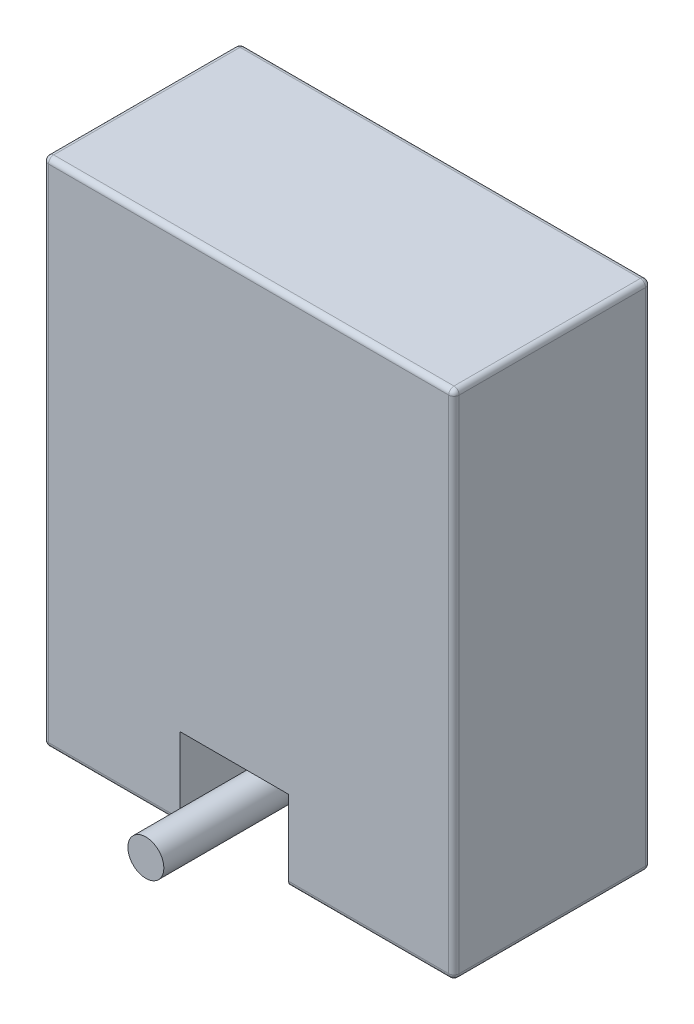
ISO-10303-21;
HEADER;
FILE_DESCRIPTION(('STEP AP214'),'2;1');
FILE_NAME('part.step','',(''),(''),'','','');
FILE_SCHEMA(('AUTOMOTIVE_DESIGN { 1 0 10303 214 1 1 1 1 }'));
ENDSEC;
DATA;
#1=APPLICATION_CONTEXT('core data for automotive mechanical design processes');
#2=APPLICATION_PROTOCOL_DEFINITION('international standard','automotive_design',2000,#1);
#3=PRODUCT_CONTEXT('',#1,'mechanical');
#4=PRODUCT('Part','Part','',(#3));
#5=PRODUCT_RELATED_PRODUCT_CATEGORY('part','',(#4));
#6=PRODUCT_DEFINITION_FORMATION('','',#4);
#7=PRODUCT_DEFINITION_CONTEXT('part definition',#1,'design');
#8=PRODUCT_DEFINITION('design','',#6,#7);
#9=PRODUCT_DEFINITION_SHAPE('','',#8);
#10=(LENGTH_UNIT() NAMED_UNIT(*) SI_UNIT(.MILLI.,.METRE.));
#11=(NAMED_UNIT(*) PLANE_ANGLE_UNIT() SI_UNIT($,.RADIAN.));
#12=(NAMED_UNIT(*) SI_UNIT($,.STERADIAN.) SOLID_ANGLE_UNIT());
#13=UNCERTAINTY_MEASURE_WITH_UNIT(LENGTH_MEASURE(1.E-05),#10,'distance_accuracy_value','');
#14=(GEOMETRIC_REPRESENTATION_CONTEXT(3) GLOBAL_UNCERTAINTY_ASSIGNED_CONTEXT((#13)) GLOBAL_UNIT_ASSIGNED_CONTEXT((#10,
#11,#12)) REPRESENTATION_CONTEXT('',''));
#15=CARTESIAN_POINT('',(0.,0.,0.));
#16=DIRECTION('',(0.,0.,1.));
#17=DIRECTION('',(1.,0.,0.));
#18=AXIS2_PLACEMENT_3D('',#15,#16,#17);
#19=CARTESIAN_POINT('',(0.,0.381,-0.381));
#20=DIRECTION('',(-1.,0.,0.));
#21=DIRECTION('',(0.,0.,1.));
#22=AXIS2_PLACEMENT_3D('',#19,#20,#21);
#23=CYLINDRICAL_SURFACE('',#22,0.381);
#24=CARTESIAN_POINT('',(9.92211623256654,0.381,-0.381));
#25=DIRECTION('',(-1.,0.,0.));
#26=DIRECTION('',(0.,0.,1.));
#27=AXIS2_PLACEMENT_3D('',#24,#25,#26);
#28=CIRCLE('',#27,0.381);
#29=CARTESIAN_POINT('',(9.92211623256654,0.381,0.));
#30=VERTEX_POINT('',#29);
#31=CARTESIAN_POINT('',(9.92211623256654,0.,-0.381));
#32=VERTEX_POINT('',#31);
#33=EDGE_CURVE('E13',#30,#32,#28,.F.);
#34=ORIENTED_EDGE('',*,*,#33,.F.);
#35=DIRECTION('',(1.,0.,0.));
#36=VECTOR('',#35,1.);
#37=CARTESIAN_POINT('',(29.8196,0.381,0.));
#38=LINE('',#37,#36);
#39=CARTESIAN_POINT('',(0.381,0.381,0.));
#40=VERTEX_POINT('',#39);
#41=EDGE_CURVE('E257',#40,#30,#38,.T.);
#42=ORIENTED_EDGE('',*,*,#41,.F.);
#43=CARTESIAN_POINT('',(0.381,0.381,-0.381));
#44=DIRECTION('',(-1.,0.,0.));
#45=DIRECTION('',(0.,0.,1.));
#46=AXIS2_PLACEMENT_3D('',#43,#44,#45);
#47=CIRCLE('',#46,0.381);
#48=CARTESIAN_POINT('',(0.381,0.,-0.381));
#49=VERTEX_POINT('',#48);
#50=EDGE_CURVE('E300',#49,#40,#47,.T.);
#51=ORIENTED_EDGE('',*,*,#50,.F.);
#52=DIRECTION('',(1.,0.,0.));
#53=VECTOR('',#52,1.);
#54=CARTESIAN_POINT('',(0.,0.,-0.381));
#55=LINE('',#54,#53);
#56=EDGE_CURVE('E209',#32,#49,#55,.F.);
#57=ORIENTED_EDGE('',*,*,#56,.F.);
#58=EDGE_LOOP('',(#34,#42,#51,#57));
#59=FACE_BOUND('',#58,.T.);
#60=ADVANCED_FACE('F47',(#59),#23,.T.);
#61=CARTESIAN_POINT('',(0.,0.,-14.2875));
#62=DIRECTION('',(-1.,0.,0.));
#63=DIRECTION('',(0.,0.,1.));
#64=AXIS2_PLACEMENT_3D('',#61,#62,#63);
#65=PLANE('',#64);
#66=DIRECTION('',(0.,-1.,0.));
#67=VECTOR('',#66,1.);
#68=CARTESIAN_POINT('',(0.,37.1348,-0.381));
#69=LINE('',#68,#67);
#70=CARTESIAN_POINT('',(0.,0.381,-0.381));
#71=VERTEX_POINT('',#70);
#72=CARTESIAN_POINT('',(0.,36.7538,-0.381));
#73=VERTEX_POINT('',#72);
#74=EDGE_CURVE('E247',#71,#73,#69,.F.);
#75=ORIENTED_EDGE('',*,*,#74,.T.);
#76=DIRECTION('',(0.,0.,1.));
#77=VECTOR('',#76,1.);
#78=CARTESIAN_POINT('',(0.,36.7538,-14.2875));
#79=LINE('',#78,#77);
#80=CARTESIAN_POINT('',(0.,36.7538,-13.9065));
#81=VERTEX_POINT('',#80);
#82=EDGE_CURVE('E252',#73,#81,#79,.F.);
#83=ORIENTED_EDGE('',*,*,#82,.T.);
#84=DIRECTION('',(0.,-1.,0.));
#85=VECTOR('',#84,1.);
#86=CARTESIAN_POINT('',(0.,0.,-13.9065));
#87=LINE('',#86,#85);
#88=CARTESIAN_POINT('',(0.,0.381,-13.9065));
#89=VERTEX_POINT('',#88);
#90=EDGE_CURVE('E249',#81,#89,#87,.T.);
#91=ORIENTED_EDGE('',*,*,#90,.T.);
#92=DIRECTION('',(0.,0.,1.));
#93=VECTOR('',#92,1.);
#94=CARTESIAN_POINT('',(0.,0.381,-14.2875));
#95=LINE('',#94,#93);
#96=EDGE_CURVE('E245',#89,#71,#95,.T.);
#97=ORIENTED_EDGE('',*,*,#96,.T.);
#98=EDGE_LOOP('',(#75,#83,#91,#97));
#99=FACE_BOUND('',#98,.T.);
#100=ADVANCED_FACE('F421',(#99),#65,.T.);
#101=CARTESIAN_POINT('',(0.,37.1348,-14.2875));
#102=DIRECTION('',(0.,1.,0.));
#103=DIRECTION('',(0.,0.,1.));
#104=AXIS2_PLACEMENT_3D('',#101,#102,#103);
#105=PLANE('',#104);
#106=DIRECTION('',(-1.,0.,0.));
#107=VECTOR('',#106,1.);
#108=CARTESIAN_POINT('',(0.,37.1348,-13.9065));
#109=LINE('',#108,#107);
#110=CARTESIAN_POINT('',(29.4386,37.1348,-13.9065));
#111=VERTEX_POINT('',#110);
#112=CARTESIAN_POINT('',(0.381,37.1348,-13.9065));
#113=VERTEX_POINT('',#112);
#114=EDGE_CURVE('E240',#111,#113,#109,.T.);
#115=ORIENTED_EDGE('',*,*,#114,.T.);
#116=DIRECTION('',(0.,0.,1.));
#117=VECTOR('',#116,1.);
#118=CARTESIAN_POINT('',(0.381,37.1348,-14.2875));
#119=LINE('',#118,#117);
#120=CARTESIAN_POINT('',(0.381,37.1348,-0.381));
#121=VERTEX_POINT('',#120);
#122=EDGE_CURVE('E243',#113,#121,#119,.T.);
#123=ORIENTED_EDGE('',*,*,#122,.T.);
#124=DIRECTION('',(-1.,0.,0.));
#125=VECTOR('',#124,1.);
#126=CARTESIAN_POINT('',(29.8196,37.1348,-0.381));
#127=LINE('',#126,#125);
#128=CARTESIAN_POINT('',(29.4386,37.1348,-0.381));
#129=VERTEX_POINT('',#128);
#130=EDGE_CURVE('E238',#121,#129,#127,.F.);
#131=ORIENTED_EDGE('',*,*,#130,.T.);
#132=DIRECTION('',(0.,0.,1.));
#133=VECTOR('',#132,1.);
#134=CARTESIAN_POINT('',(29.4386,37.1348,-14.2875));
#135=LINE('',#134,#133);
#136=EDGE_CURVE('E236',#129,#111,#135,.F.);
#137=ORIENTED_EDGE('',*,*,#136,.T.);
#138=EDGE_LOOP('',(#115,#123,#131,#137));
#139=FACE_BOUND('',#138,.T.);
#140=ADVANCED_FACE('F399',(#139),#105,.T.);
#141=CARTESIAN_POINT('',(29.8196,0.,-14.2875));
#142=DIRECTION('',(1.,0.,0.));
#143=DIRECTION('',(0.,0.,-1.));
#144=AXIS2_PLACEMENT_3D('',#141,#142,#143);
#145=PLANE('',#144);
#146=DIRECTION('',(0.,1.,0.));
#147=VECTOR('',#146,1.);
#148=CARTESIAN_POINT('',(29.8196,0.,-0.381));
#149=LINE('',#148,#147);
#150=CARTESIAN_POINT('',(29.8196,36.7538,-0.381));
#151=VERTEX_POINT('',#150);
#152=CARTESIAN_POINT('',(29.8196,0.381,-0.381));
#153=VERTEX_POINT('',#152);
#154=EDGE_CURVE('E229',#151,#153,#149,.F.);
#155=ORIENTED_EDGE('',*,*,#154,.T.);
#156=DIRECTION('',(0.,0.,1.));
#157=VECTOR('',#156,1.);
#158=CARTESIAN_POINT('',(29.8196,0.381,-14.2875));
#159=LINE('',#158,#157);
#160=CARTESIAN_POINT('',(29.8196,0.381,-13.9065));
#161=VERTEX_POINT('',#160);
#162=EDGE_CURVE('E234',#153,#161,#159,.F.);
#163=ORIENTED_EDGE('',*,*,#162,.T.);
#164=DIRECTION('',(0.,1.,0.));
#165=VECTOR('',#164,1.);
#166=CARTESIAN_POINT('',(29.8196,0.,-13.9065));
#167=LINE('',#166,#165);
#168=CARTESIAN_POINT('',(29.8196,36.7538,-13.9065));
#169=VERTEX_POINT('',#168);
#170=EDGE_CURVE('E231',#161,#169,#167,.T.);
#171=ORIENTED_EDGE('',*,*,#170,.T.);
#172=DIRECTION('',(0.,0.,1.));
#173=VECTOR('',#172,1.);
#174=CARTESIAN_POINT('',(29.8196,36.7538,-14.2875));
#175=LINE('',#174,#173);
#176=EDGE_CURVE('E227',#169,#151,#175,.T.);
#177=ORIENTED_EDGE('',*,*,#176,.T.);
#178=EDGE_LOOP('',(#155,#163,#171,#177));
#179=FACE_BOUND('',#178,.T.);
#180=ADVANCED_FACE('F385',(#179),#145,.T.);
#181=CARTESIAN_POINT('',(0.,0.,-14.2875));
#182=DIRECTION('',(0.,-1.,0.));
#183=DIRECTION('',(0.,0.,-1.));
#184=AXIS2_PLACEMENT_3D('',#181,#182,#183);
#185=PLANE('',#184);
#186=DIRECTION('',(0.,0.,1.));
#187=VECTOR('',#186,1.);
#188=CARTESIAN_POINT('',(9.92211623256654,0.,-6.35));
#189=LINE('',#188,#187);
#190=CARTESIAN_POINT('',(9.92211623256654,0.,-6.35));
#191=VERTEX_POINT('',#190);
#192=EDGE_CURVE('E166',#191,#32,#189,.T.);
#193=ORIENTED_EDGE('',*,*,#192,.T.);
#194=ORIENTED_EDGE('',*,*,#56,.T.);
#195=DIRECTION('',(0.,0.,1.));
#196=VECTOR('',#195,1.);
#197=CARTESIAN_POINT('',(0.381,0.,-14.2875));
#198=LINE('',#197,#196);
#199=CARTESIAN_POINT('',(0.381,0.,-13.9065));
#200=VERTEX_POINT('',#199);
#201=EDGE_CURVE('E216',#49,#200,#198,.F.);
#202=ORIENTED_EDGE('',*,*,#201,.T.);
#203=DIRECTION('',(1.,0.,0.));
#204=VECTOR('',#203,1.);
#205=CARTESIAN_POINT('',(0.,0.,-13.9065));
#206=LINE('',#205,#204);
#207=CARTESIAN_POINT('',(29.4386,0.,-13.9065));
#208=VERTEX_POINT('',#207);
#209=EDGE_CURVE('E213',#200,#208,#206,.T.);
#210=ORIENTED_EDGE('',*,*,#209,.T.);
#211=DIRECTION('',(0.,0.,1.));
#212=VECTOR('',#211,1.);
#213=CARTESIAN_POINT('',(29.4386,0.,-14.2875));
#214=LINE('',#213,#212);
#215=CARTESIAN_POINT('',(29.4386,0.,-0.381));
#216=VERTEX_POINT('',#215);
#217=EDGE_CURVE('E207',#208,#216,#214,.T.);
#218=ORIENTED_EDGE('',*,*,#217,.T.);
#219=CARTESIAN_POINT('',(17.808624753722,0.,-0.381));
#220=VERTEX_POINT('',#219);
#221=EDGE_CURVE('E211',#216,#220,#55,.F.);
#222=ORIENTED_EDGE('',*,*,#221,.T.);
#223=DIRECTION('',(0.,0.,1.));
#224=VECTOR('',#223,1.);
#225=CARTESIAN_POINT('',(17.808624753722,0.,-6.35));
#226=LINE('',#225,#224);
#227=CARTESIAN_POINT('',(17.808624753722,0.,-6.35));
#228=VERTEX_POINT('',#227);
#229=EDGE_CURVE('E62',#228,#220,#226,.T.);
#230=ORIENTED_EDGE('',*,*,#229,.F.);
#231=DIRECTION('',(1.,0.,0.));
#232=VECTOR('',#231,1.);
#233=CARTESIAN_POINT('',(9.92211623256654,0.,-6.35));
#234=LINE('',#233,#232);
#235=EDGE_CURVE('E181',#191,#228,#234,.T.);
#236=ORIENTED_EDGE('',*,*,#235,.F.);
#237=EDGE_LOOP('',(#193,#194,#202,#210,#218,#222,#230,#236));
#238=FACE_BOUND('',#237,.T.);
#239=ADVANCED_FACE('F185',(#238),#185,.T.);
#240=CARTESIAN_POINT('',(0.,0.,-14.2875));
#241=DIRECTION('',(0.,0.,-1.));
#242=DIRECTION('',(-1.,0.,0.));
#243=AXIS2_PLACEMENT_3D('',#240,#241,#242);
#244=PLANE('',#243);
#245=DIRECTION('',(0.,1.,0.));
#246=VECTOR('',#245,1.);
#247=CARTESIAN_POINT('',(29.4386,0.,-14.2875));
#248=LINE('',#247,#246);
#249=CARTESIAN_POINT('',(29.4386,36.7538,-14.2875));
#250=VERTEX_POINT('',#249);
#251=CARTESIAN_POINT('',(29.4386,0.381,-14.2875));
#252=VERTEX_POINT('',#251);
#253=EDGE_CURVE('E222',#250,#252,#248,.F.);
#254=ORIENTED_EDGE('',*,*,#253,.T.);
#255=DIRECTION('',(1.,0.,0.));
#256=VECTOR('',#255,1.);
#257=CARTESIAN_POINT('',(0.,0.381,-14.2875));
#258=LINE('',#257,#256);
#259=CARTESIAN_POINT('',(0.381,0.381,-14.2875));
#260=VERTEX_POINT('',#259);
#261=EDGE_CURVE('E224',#252,#260,#258,.F.);
#262=ORIENTED_EDGE('',*,*,#261,.T.);
#263=DIRECTION('',(0.,-1.,0.));
#264=VECTOR('',#263,1.);
#265=CARTESIAN_POINT('',(0.381,0.,-14.2875));
#266=LINE('',#265,#264);
#267=CARTESIAN_POINT('',(0.381,36.7538,-14.2875));
#268=VERTEX_POINT('',#267);
#269=EDGE_CURVE('E218',#260,#268,#266,.F.);
#270=ORIENTED_EDGE('',*,*,#269,.T.);
#271=DIRECTION('',(-1.,0.,0.));
#272=VECTOR('',#271,1.);
#273=CARTESIAN_POINT('',(0.,36.7538,-14.2875));
#274=LINE('',#273,#272);
#275=EDGE_CURVE('E220',#268,#250,#274,.F.);
#276=ORIENTED_EDGE('',*,*,#275,.T.);
#277=EDGE_LOOP('',(#254,#262,#270,#276));
#278=FACE_BOUND('',#277,.T.);
#279=ADVANCED_FACE('F462',(#278),#244,.T.);
#280=CARTESIAN_POINT('',(0.,0.,0.));
#281=DIRECTION('',(0.,0.,-1.));
#282=DIRECTION('',(-1.,0.,0.));
#283=AXIS2_PLACEMENT_3D('',#280,#281,#282);
#284=PLANE('',#283);
#285=ORIENTED_EDGE('',*,*,#41,.T.);
#286=DIRECTION('',(0.,-1.,0.));
#287=VECTOR('',#286,1.);
#288=CARTESIAN_POINT('',(9.92211623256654,5.84241192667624,0.));
#289=LINE('',#288,#287);
#290=CARTESIAN_POINT('',(9.92211623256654,5.84241192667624,0.));
#291=VERTEX_POINT('',#290);
#292=EDGE_CURVE('E193',#291,#30,#289,.T.);
#293=ORIENTED_EDGE('',*,*,#292,.F.);
#294=DIRECTION('',(-1.,0.,0.));
#295=VECTOR('',#294,1.);
#296=CARTESIAN_POINT('',(9.92211623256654,5.84241192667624,0.));
#297=LINE('',#296,#295);
#298=CARTESIAN_POINT('',(17.808624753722,5.84241192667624,0.));
#299=VERTEX_POINT('',#298);
#300=EDGE_CURVE('E183',#299,#291,#297,.T.);
#301=ORIENTED_EDGE('',*,*,#300,.F.);
#302=DIRECTION('',(0.,1.,0.));
#303=VECTOR('',#302,1.);
#304=CARTESIAN_POINT('',(17.808624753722,5.84241192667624,0.));
#305=LINE('',#304,#303);
#306=CARTESIAN_POINT('',(17.808624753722,0.381,0.));
#307=VERTEX_POINT('',#306);
#308=EDGE_CURVE('E195',#307,#299,#305,.T.);
#309=ORIENTED_EDGE('',*,*,#308,.F.);
#310=CARTESIAN_POINT('',(29.4386,0.381,0.));
#311=VERTEX_POINT('',#310);
#312=EDGE_CURVE('E256',#307,#311,#38,.T.);
#313=ORIENTED_EDGE('',*,*,#312,.T.);
#314=DIRECTION('',(0.,1.,0.));
#315=VECTOR('',#314,1.);
#316=CARTESIAN_POINT('',(29.4386,37.1348,0.));
#317=LINE('',#316,#315);
#318=CARTESIAN_POINT('',(29.4386,36.7538,0.));
#319=VERTEX_POINT('',#318);
#320=EDGE_CURVE('E70',#311,#319,#317,.T.);
#321=ORIENTED_EDGE('',*,*,#320,.T.);
#322=DIRECTION('',(-1.,0.,0.));
#323=VECTOR('',#322,1.);
#324=CARTESIAN_POINT('',(0.,36.7538,0.));
#325=LINE('',#324,#323);
#326=CARTESIAN_POINT('',(0.381,36.7538,0.));
#327=VERTEX_POINT('',#326);
#328=EDGE_CURVE('E261',#319,#327,#325,.T.);
#329=ORIENTED_EDGE('',*,*,#328,.T.);
#330=DIRECTION('',(0.,-1.,0.));
#331=VECTOR('',#330,1.);
#332=CARTESIAN_POINT('',(0.381,0.,0.));
#333=LINE('',#332,#331);
#334=EDGE_CURVE('E254',#327,#40,#333,.T.);
#335=ORIENTED_EDGE('',*,*,#334,.T.);
#336=EDGE_LOOP('',(#285,#293,#301,#309,#313,#321,#329,#335));
#337=FACE_BOUND('',#336,.T.);
#338=ADVANCED_FACE('F333',(#337),#284,.F.);
#339=CARTESIAN_POINT('',(0.,36.7538,-0.381));
#340=DIRECTION('',(1.,0.,0.));
#341=DIRECTION('',(0.,0.,-1.));
#342=AXIS2_PLACEMENT_3D('',#339,#340,#341);
#343=CYLINDRICAL_SURFACE('',#342,0.381);
#344=CARTESIAN_POINT('',(0.381,36.7538,-0.381));
#345=DIRECTION('',(-1.,0.,0.));
#346=DIRECTION('',(0.,0.,1.));
#347=AXIS2_PLACEMENT_3D('',#344,#345,#346);
#348=CIRCLE('',#347,0.381);
#349=EDGE_CURVE('E210',#327,#121,#348,.T.);
#350=ORIENTED_EDGE('',*,*,#349,.F.);
#351=ORIENTED_EDGE('',*,*,#328,.F.);
#352=CARTESIAN_POINT('',(29.4386,36.7538,-0.381));
#353=DIRECTION('',(1.,0.,0.));
#354=DIRECTION('',(0.,0.,-1.));
#355=AXIS2_PLACEMENT_3D('',#352,#353,#354);
#356=CIRCLE('',#355,0.381);
#357=EDGE_CURVE('E323',#129,#319,#356,.T.);
#358=ORIENTED_EDGE('',*,*,#357,.F.);
#359=ORIENTED_EDGE('',*,*,#130,.F.);
#360=EDGE_LOOP('',(#350,#351,#358,#359));
#361=FACE_BOUND('',#360,.T.);
#362=ADVANCED_FACE('F49',(#361),#343,.T.);
#363=CARTESIAN_POINT('',(0.381,36.7538,-0.381));
#364=DIRECTION('',(0.,0.,1.));
#365=DIRECTION('',(1.,0.,0.));
#366=AXIS2_PLACEMENT_3D('',#363,#364,#365);
#367=SPHERICAL_SURFACE('',#366,0.381);
#368=CARTESIAN_POINT('',(0.381,36.7538,-0.381));
#369=DIRECTION('',(0.,1.,0.));
#370=DIRECTION('',(0.,0.,1.));
#371=AXIS2_PLACEMENT_3D('',#368,#369,#370);
#372=CIRCLE('',#371,0.381);
#373=EDGE_CURVE('E317',#327,#73,#372,.F.);
#374=ORIENTED_EDGE('',*,*,#373,.F.);
#375=ORIENTED_EDGE('',*,*,#349,.T.);
#376=CARTESIAN_POINT('',(0.381,36.7538,-0.381));
#377=DIRECTION('',(0.,0.,1.));
#378=DIRECTION('',(1.,0.,0.));
#379=AXIS2_PLACEMENT_3D('',#376,#377,#378);
#380=CIRCLE('',#379,0.381);
#381=EDGE_CURVE('E320',#73,#121,#380,.F.);
#382=ORIENTED_EDGE('',*,*,#381,.F.);
#383=EDGE_LOOP('',(#374,#375,#382));
#384=FACE_BOUND('',#383,.T.);
#385=ADVANCED_FACE('F413',(#384),#367,.T.);
#386=CARTESIAN_POINT('',(29.4386,36.7538,-0.381));
#387=DIRECTION('',(0.,0.,1.));
#388=DIRECTION('',(1.,0.,0.));
#389=AXIS2_PLACEMENT_3D('',#386,#387,#388);
#390=SPHERICAL_SURFACE('',#389,0.381);
#391=CARTESIAN_POINT('',(29.4386,36.7538,-0.381));
#392=DIRECTION('',(0.,0.,1.));
#393=DIRECTION('',(1.,0.,0.));
#394=AXIS2_PLACEMENT_3D('',#391,#392,#393);
#395=CIRCLE('',#394,0.381);
#396=EDGE_CURVE('E311',#129,#151,#395,.F.);
#397=ORIENTED_EDGE('',*,*,#396,.F.);
#398=ORIENTED_EDGE('',*,*,#357,.T.);
#399=CARTESIAN_POINT('',(29.4386,36.7538,-0.381));
#400=DIRECTION('',(0.,1.,0.));
#401=DIRECTION('',(0.,0.,1.));
#402=AXIS2_PLACEMENT_3D('',#399,#400,#401);
#403=CIRCLE('',#402,0.381);
#404=EDGE_CURVE('E314',#151,#319,#403,.F.);
#405=ORIENTED_EDGE('',*,*,#404,.F.);
#406=EDGE_LOOP('',(#397,#398,#405));
#407=FACE_BOUND('',#406,.T.);
#408=ADVANCED_FACE('F348',(#407),#390,.T.);
#409=CARTESIAN_POINT('',(0.381,36.7538,-14.2875));
#410=DIRECTION('',(0.,0.,1.));
#411=DIRECTION('',(1.,0.,0.));
#412=AXIS2_PLACEMENT_3D('',#409,#410,#411);
#413=CYLINDRICAL_SURFACE('',#412,0.381);
#414=ORIENTED_EDGE('',*,*,#381,.T.);
#415=ORIENTED_EDGE('',*,*,#122,.F.);
#416=CARTESIAN_POINT('',(0.381,36.7538,-13.9065));
#417=DIRECTION('',(0.,0.,-1.));
#418=DIRECTION('',(-1.,0.,0.));
#419=AXIS2_PLACEMENT_3D('',#416,#417,#418);
#420=CIRCLE('',#419,0.381);
#421=EDGE_CURVE('E306',#81,#113,#420,.T.);
#422=ORIENTED_EDGE('',*,*,#421,.F.);
#423=ORIENTED_EDGE('',*,*,#82,.F.);
#424=EDGE_LOOP('',(#414,#415,#422,#423));
#425=FACE_BOUND('',#424,.T.);
#426=ADVANCED_FACE('F409',(#425),#413,.T.);
#427=CARTESIAN_POINT('',(0.381,0.,-0.381));
#428=DIRECTION('',(0.,1.,0.));
#429=DIRECTION('',(0.,0.,1.));
#430=AXIS2_PLACEMENT_3D('',#427,#428,#429);
#431=CYLINDRICAL_SURFACE('',#430,0.381);
#432=ORIENTED_EDGE('',*,*,#373,.T.);
#433=ORIENTED_EDGE('',*,*,#74,.F.);
#434=CARTESIAN_POINT('',(0.381,0.381,-0.381));
#435=DIRECTION('',(0.,-1.,0.));
#436=DIRECTION('',(0.,0.,-1.));
#437=AXIS2_PLACEMENT_3D('',#434,#435,#436);
#438=CIRCLE('',#437,0.381);
#439=EDGE_CURVE('E303',#40,#71,#438,.T.);
#440=ORIENTED_EDGE('',*,*,#439,.F.);
#441=ORIENTED_EDGE('',*,*,#334,.F.);
#442=EDGE_LOOP('',(#432,#433,#440,#441));
#443=FACE_BOUND('',#442,.T.);
#444=ADVANCED_FACE('F362',(#443),#431,.T.);
#445=CARTESIAN_POINT('',(17.808624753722,0.381,-0.381));
#446=DIRECTION('',(1.,0.,0.));
#447=DIRECTION('',(0.,0.,-1.));
#448=AXIS2_PLACEMENT_3D('',#445,#446,#447);
#449=CIRCLE('',#448,0.381);
#450=EDGE_CURVE('E55',#220,#307,#449,.F.);
#451=ORIENTED_EDGE('',*,*,#450,.F.);
#452=ORIENTED_EDGE('',*,*,#221,.F.);
#453=CARTESIAN_POINT('',(29.4386,0.381,-0.381));
#454=DIRECTION('',(1.,0.,0.));
#455=DIRECTION('',(0.,0.,-1.));
#456=AXIS2_PLACEMENT_3D('',#453,#454,#455);
#457=CIRCLE('',#456,0.381);
#458=EDGE_CURVE('E297',#311,#216,#457,.T.);
#459=ORIENTED_EDGE('',*,*,#458,.F.);
#460=ORIENTED_EDGE('',*,*,#312,.F.);
#461=EDGE_LOOP('',(#451,#452,#459,#460));
#462=FACE_BOUND('',#461,.T.);
#463=ADVANCED_FACE('F336',(#462),#23,.T.);
#464=CARTESIAN_POINT('',(29.4386,0.,-0.381));
#465=DIRECTION('',(0.,-1.,0.));
#466=DIRECTION('',(0.,0.,-1.));
#467=AXIS2_PLACEMENT_3D('',#464,#465,#466);
#468=CYLINDRICAL_SURFACE('',#467,0.381);
#469=ORIENTED_EDGE('',*,*,#404,.T.);
#470=ORIENTED_EDGE('',*,*,#320,.F.);
#471=CARTESIAN_POINT('',(29.4386,0.381,-0.381));
#472=DIRECTION('',(0.,-1.,0.));
#473=DIRECTION('',(0.,0.,-1.));
#474=AXIS2_PLACEMENT_3D('',#471,#472,#473);
#475=CIRCLE('',#474,0.381);
#476=EDGE_CURVE('E294',#153,#311,#475,.T.);
#477=ORIENTED_EDGE('',*,*,#476,.F.);
#478=ORIENTED_EDGE('',*,*,#154,.F.);
#479=EDGE_LOOP('',(#469,#470,#477,#478));
#480=FACE_BOUND('',#479,.T.);
#481=ADVANCED_FACE('F344',(#480),#468,.T.);
#482=CARTESIAN_POINT('',(29.4386,36.7538,-14.2875));
#483=DIRECTION('',(0.,0.,1.));
#484=DIRECTION('',(1.,0.,0.));
#485=AXIS2_PLACEMENT_3D('',#482,#483,#484);
#486=CYLINDRICAL_SURFACE('',#485,0.381);
#487=ORIENTED_EDGE('',*,*,#396,.T.);
#488=ORIENTED_EDGE('',*,*,#176,.F.);
#489=CARTESIAN_POINT('',(29.4386,36.7538,-13.9065));
#490=DIRECTION('',(0.,0.,-1.));
#491=DIRECTION('',(-1.,0.,0.));
#492=AXIS2_PLACEMENT_3D('',#489,#490,#491);
#493=CIRCLE('',#492,0.381);
#494=EDGE_CURVE('E291',#111,#169,#493,.T.);
#495=ORIENTED_EDGE('',*,*,#494,.F.);
#496=ORIENTED_EDGE('',*,*,#136,.F.);
#497=EDGE_LOOP('',(#487,#488,#495,#496));
#498=FACE_BOUND('',#497,.T.);
#499=ADVANCED_FACE('F396',(#498),#486,.T.);
#500=CARTESIAN_POINT('',(0.,36.7538,-13.9065));
#501=DIRECTION('',(-1.,0.,0.));
#502=DIRECTION('',(0.,0.,1.));
#503=AXIS2_PLACEMENT_3D('',#500,#501,#502);
#504=CYLINDRICAL_SURFACE('',#503,0.381);
#505=CARTESIAN_POINT('',(0.381,36.7538,-13.9065));
#506=DIRECTION('',(-1.,0.,0.));
#507=DIRECTION('',(0.,0.,1.));
#508=AXIS2_PLACEMENT_3D('',#505,#506,#507);
#509=CIRCLE('',#508,0.381);
#510=EDGE_CURVE('E308',#113,#268,#509,.T.);
#511=ORIENTED_EDGE('',*,*,#510,.F.);
#512=ORIENTED_EDGE('',*,*,#114,.F.);
#513=CARTESIAN_POINT('',(29.4386,36.7538,-13.9065));
#514=DIRECTION('',(1.,0.,0.));
#515=DIRECTION('',(0.,0.,-1.));
#516=AXIS2_PLACEMENT_3D('',#513,#514,#515);
#517=CIRCLE('',#516,0.381);
#518=EDGE_CURVE('E288',#250,#111,#517,.T.);
#519=ORIENTED_EDGE('',*,*,#518,.F.);
#520=ORIENTED_EDGE('',*,*,#275,.F.);
#521=EDGE_LOOP('',(#511,#512,#519,#520));
#522=FACE_BOUND('',#521,.T.);
#523=ADVANCED_FACE('F402',(#522),#504,.T.);
#524=CARTESIAN_POINT('',(0.381,36.7538,-13.9065));
#525=DIRECTION('',(0.,0.,1.));
#526=DIRECTION('',(1.,0.,0.));
#527=AXIS2_PLACEMENT_3D('',#524,#525,#526);
#528=SPHERICAL_SURFACE('',#527,0.381);
#529=ORIENTED_EDGE('',*,*,#421,.T.);
#530=ORIENTED_EDGE('',*,*,#510,.T.);
#531=CARTESIAN_POINT('',(0.381,36.7538,-13.9065));
#532=DIRECTION('',(0.,1.,0.));
#533=DIRECTION('',(0.,0.,1.));
#534=AXIS2_PLACEMENT_3D('',#531,#532,#533);
#535=CIRCLE('',#534,0.381);
#536=EDGE_CURVE('E285',#81,#268,#535,.F.);
#537=ORIENTED_EDGE('',*,*,#536,.F.);
#538=EDGE_LOOP('',(#529,#530,#537));
#539=FACE_BOUND('',#538,.T.);
#540=ADVANCED_FACE('F522',(#539),#528,.T.);
#541=CARTESIAN_POINT('',(0.381,0.381,-0.381));
#542=DIRECTION('',(0.,0.,1.));
#543=DIRECTION('',(1.,0.,0.));
#544=AXIS2_PLACEMENT_3D('',#541,#542,#543);
#545=SPHERICAL_SURFACE('',#544,0.381);
#546=ORIENTED_EDGE('',*,*,#50,.T.);
#547=ORIENTED_EDGE('',*,*,#439,.T.);
#548=CARTESIAN_POINT('',(0.381,0.381,-0.381));
#549=DIRECTION('',(0.,0.,1.));
#550=DIRECTION('',(1.,0.,0.));
#551=AXIS2_PLACEMENT_3D('',#548,#549,#550);
#552=CIRCLE('',#551,0.381);
#553=EDGE_CURVE('E282',#49,#71,#552,.F.);
#554=ORIENTED_EDGE('',*,*,#553,.F.);
#555=EDGE_LOOP('',(#546,#547,#554));
#556=FACE_BOUND('',#555,.T.);
#557=ADVANCED_FACE('F364',(#556),#545,.T.);
#558=CARTESIAN_POINT('',(29.4386,0.381,-0.381));
#559=DIRECTION('',(0.,0.,1.));
#560=DIRECTION('',(1.,0.,0.));
#561=AXIS2_PLACEMENT_3D('',#558,#559,#560);
#562=SPHERICAL_SURFACE('',#561,0.381);
#563=ORIENTED_EDGE('',*,*,#476,.T.);
#564=ORIENTED_EDGE('',*,*,#458,.T.);
#565=CARTESIAN_POINT('',(29.4386,0.381,-0.381));
#566=DIRECTION('',(0.,0.,1.));
#567=DIRECTION('',(1.,0.,0.));
#568=AXIS2_PLACEMENT_3D('',#565,#566,#567);
#569=CIRCLE('',#568,0.381);
#570=EDGE_CURVE('E279',#153,#216,#569,.F.);
#571=ORIENTED_EDGE('',*,*,#570,.F.);
#572=EDGE_LOOP('',(#563,#564,#571));
#573=FACE_BOUND('',#572,.T.);
#574=ADVANCED_FACE('F340',(#573),#562,.T.);
#575=CARTESIAN_POINT('',(29.4386,36.7538,-13.9065));
#576=DIRECTION('',(0.,0.,1.));
#577=DIRECTION('',(1.,0.,0.));
#578=AXIS2_PLACEMENT_3D('',#575,#576,#577);
#579=SPHERICAL_SURFACE('',#578,0.381);
#580=ORIENTED_EDGE('',*,*,#518,.T.);
#581=ORIENTED_EDGE('',*,*,#494,.T.);
#582=CARTESIAN_POINT('',(29.4386,36.7538,-13.9065));
#583=DIRECTION('',(0.,1.,0.));
#584=DIRECTION('',(0.,0.,1.));
#585=AXIS2_PLACEMENT_3D('',#582,#583,#584);
#586=CIRCLE('',#585,0.381);
#587=EDGE_CURVE('E277',#250,#169,#586,.F.);
#588=ORIENTED_EDGE('',*,*,#587,.F.);
#589=EDGE_LOOP('',(#580,#581,#588));
#590=FACE_BOUND('',#589,.T.);
#591=ADVANCED_FACE('F393',(#590),#579,.T.);
#592=CARTESIAN_POINT('',(0.381,0.,-13.9065));
#593=DIRECTION('',(0.,-1.,0.));
#594=DIRECTION('',(0.,0.,-1.));
#595=AXIS2_PLACEMENT_3D('',#592,#593,#594);
#596=CYLINDRICAL_SURFACE('',#595,0.381);
#597=ORIENTED_EDGE('',*,*,#536,.T.);
#598=ORIENTED_EDGE('',*,*,#269,.F.);
#599=CARTESIAN_POINT('',(0.381,0.381,-13.9065));
#600=DIRECTION('',(0.,-1.,0.));
#601=DIRECTION('',(0.,0.,-1.));
#602=AXIS2_PLACEMENT_3D('',#599,#600,#601);
#603=CIRCLE('',#602,0.381);
#604=EDGE_CURVE('E274',#89,#260,#603,.T.);
#605=ORIENTED_EDGE('',*,*,#604,.F.);
#606=ORIENTED_EDGE('',*,*,#90,.F.);
#607=EDGE_LOOP('',(#597,#598,#605,#606));
#608=FACE_BOUND('',#607,.T.);
#609=ADVANCED_FACE('F512',(#608),#596,.T.);
#610=CARTESIAN_POINT('',(0.381,0.381,-14.2875));
#611=DIRECTION('',(0.,0.,1.));
#612=DIRECTION('',(1.,0.,0.));
#613=AXIS2_PLACEMENT_3D('',#610,#611,#612);
#614=CYLINDRICAL_SURFACE('',#613,0.381);
#615=ORIENTED_EDGE('',*,*,#553,.T.);
#616=ORIENTED_EDGE('',*,*,#96,.F.);
#617=CARTESIAN_POINT('',(0.381,0.381,-13.9065));
#618=DIRECTION('',(0.,0.,-1.));
#619=DIRECTION('',(-1.,0.,0.));
#620=AXIS2_PLACEMENT_3D('',#617,#618,#619);
#621=CIRCLE('',#620,0.381);
#622=EDGE_CURVE('E272',#200,#89,#621,.T.);
#623=ORIENTED_EDGE('',*,*,#622,.F.);
#624=ORIENTED_EDGE('',*,*,#201,.F.);
#625=EDGE_LOOP('',(#615,#616,#623,#624));
#626=FACE_BOUND('',#625,.T.);
#627=ADVANCED_FACE('F369',(#626),#614,.T.);
#628=CARTESIAN_POINT('',(29.4386,0.381,-14.2875));
#629=DIRECTION('',(0.,0.,1.));
#630=DIRECTION('',(1.,0.,0.));
#631=AXIS2_PLACEMENT_3D('',#628,#629,#630);
#632=CYLINDRICAL_SURFACE('',#631,0.381);
#633=ORIENTED_EDGE('',*,*,#570,.T.);
#634=ORIENTED_EDGE('',*,*,#217,.F.);
#635=CARTESIAN_POINT('',(29.4386,0.381,-13.9065));
#636=DIRECTION('',(0.,0.,-1.));
#637=DIRECTION('',(-1.,0.,0.));
#638=AXIS2_PLACEMENT_3D('',#635,#636,#637);
#639=CIRCLE('',#638,0.381);
#640=EDGE_CURVE('E269',#161,#208,#639,.T.);
#641=ORIENTED_EDGE('',*,*,#640,.F.);
#642=ORIENTED_EDGE('',*,*,#162,.F.);
#643=EDGE_LOOP('',(#633,#634,#641,#642));
#644=FACE_BOUND('',#643,.T.);
#645=ADVANCED_FACE('F382',(#644),#632,.T.);
#646=CARTESIAN_POINT('',(29.4386,0.,-13.9065));
#647=DIRECTION('',(0.,1.,0.));
#648=DIRECTION('',(0.,0.,1.));
#649=AXIS2_PLACEMENT_3D('',#646,#647,#648);
#650=CYLINDRICAL_SURFACE('',#649,0.381);
#651=ORIENTED_EDGE('',*,*,#587,.T.);
#652=ORIENTED_EDGE('',*,*,#170,.F.);
#653=CARTESIAN_POINT('',(29.4386,0.381,-13.9065));
#654=DIRECTION('',(0.,-1.,0.));
#655=DIRECTION('',(0.,0.,-1.));
#656=AXIS2_PLACEMENT_3D('',#653,#654,#655);
#657=CIRCLE('',#656,0.381);
#658=EDGE_CURVE('E266',#252,#161,#657,.T.);
#659=ORIENTED_EDGE('',*,*,#658,.F.);
#660=ORIENTED_EDGE('',*,*,#253,.F.);
#661=EDGE_LOOP('',(#651,#652,#659,#660));
#662=FACE_BOUND('',#661,.T.);
#663=ADVANCED_FACE('F387',(#662),#650,.T.);
#664=CARTESIAN_POINT('',(0.381,0.381,-13.9065));
#665=DIRECTION('',(0.,0.,1.));
#666=DIRECTION('',(1.,0.,0.));
#667=AXIS2_PLACEMENT_3D('',#664,#665,#666);
#668=SPHERICAL_SURFACE('',#667,0.381);
#669=ORIENTED_EDGE('',*,*,#622,.T.);
#670=ORIENTED_EDGE('',*,*,#604,.T.);
#671=CARTESIAN_POINT('',(0.381,0.381,-13.9065));
#672=DIRECTION('',(-1.,0.,0.));
#673=DIRECTION('',(0.,0.,1.));
#674=AXIS2_PLACEMENT_3D('',#671,#672,#673);
#675=CIRCLE('',#674,0.381);
#676=EDGE_CURVE('E264',#200,#260,#675,.F.);
#677=ORIENTED_EDGE('',*,*,#676,.F.);
#678=EDGE_LOOP('',(#669,#670,#677));
#679=FACE_BOUND('',#678,.T.);
#680=ADVANCED_FACE('F502',(#679),#668,.T.);
#681=CARTESIAN_POINT('',(29.4386,0.381,-13.9065));
#682=DIRECTION('',(0.,0.,1.));
#683=DIRECTION('',(1.,0.,0.));
#684=AXIS2_PLACEMENT_3D('',#681,#682,#683);
#685=SPHERICAL_SURFACE('',#684,0.381);
#686=ORIENTED_EDGE('',*,*,#658,.T.);
#687=ORIENTED_EDGE('',*,*,#640,.T.);
#688=CARTESIAN_POINT('',(29.4386,0.381,-13.9065));
#689=DIRECTION('',(1.,0.,0.));
#690=DIRECTION('',(0.,0.,-1.));
#691=AXIS2_PLACEMENT_3D('',#688,#689,#690);
#692=CIRCLE('',#691,0.381);
#693=EDGE_CURVE('E202',#252,#208,#692,.F.);
#694=ORIENTED_EDGE('',*,*,#693,.F.);
#695=EDGE_LOOP('',(#686,#687,#694));
#696=FACE_BOUND('',#695,.T.);
#697=ADVANCED_FACE('F379',(#696),#685,.T.);
#698=CARTESIAN_POINT('',(0.,0.381,-13.9065));
#699=DIRECTION('',(1.,0.,0.));
#700=DIRECTION('',(0.,0.,-1.));
#701=AXIS2_PLACEMENT_3D('',#698,#699,#700);
#702=CYLINDRICAL_SURFACE('',#701,0.381);
#703=ORIENTED_EDGE('',*,*,#676,.T.);
#704=ORIENTED_EDGE('',*,*,#261,.F.);
#705=ORIENTED_EDGE('',*,*,#693,.T.);
#706=ORIENTED_EDGE('',*,*,#209,.F.);
#707=EDGE_LOOP('',(#703,#704,#705,#706));
#708=FACE_BOUND('',#707,.T.);
#709=ADVANCED_FACE('F374',(#708),#702,.T.);
#710=CARTESIAN_POINT('',(9.92211623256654,5.84241192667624,-6.35));
#711=DIRECTION('',(-1.,0.,0.));
#712=DIRECTION('',(0.,0.,1.));
#713=AXIS2_PLACEMENT_3D('',#710,#711,#712);
#714=PLANE('',#713);
#715=ORIENTED_EDGE('',*,*,#33,.T.);
#716=ORIENTED_EDGE('',*,*,#192,.F.);
#717=DIRECTION('',(0.,-1.,0.));
#718=VECTOR('',#717,1.);
#719=CARTESIAN_POINT('',(9.92211623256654,5.84241192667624,-6.35));
#720=LINE('',#719,#718);
#721=CARTESIAN_POINT('',(9.92211623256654,5.84241192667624,-6.35));
#722=VERTEX_POINT('',#721);
#723=EDGE_CURVE('E169',#722,#191,#720,.T.);
#724=ORIENTED_EDGE('',*,*,#723,.F.);
#725=DIRECTION('',(0.,0.,1.));
#726=VECTOR('',#725,1.);
#727=CARTESIAN_POINT('',(9.92211623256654,5.84241192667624,-6.35));
#728=LINE('',#727,#726);
#729=EDGE_CURVE('E200',#722,#291,#728,.T.);
#730=ORIENTED_EDGE('',*,*,#729,.T.);
#731=ORIENTED_EDGE('',*,*,#292,.T.);
#732=EDGE_LOOP('',(#715,#716,#724,#730,#731));
#733=FACE_BOUND('',#732,.T.);
#734=ADVANCED_FACE('F168',(#733),#714,.F.);
#735=CARTESIAN_POINT('',(9.92211623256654,5.84241192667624,-6.35));
#736=DIRECTION('',(0.,1.,0.));
#737=DIRECTION('',(0.,0.,1.));
#738=AXIS2_PLACEMENT_3D('',#735,#736,#737);
#739=PLANE('',#738);
#740=ORIENTED_EDGE('',*,*,#300,.T.);
#741=ORIENTED_EDGE('',*,*,#729,.F.);
#742=DIRECTION('',(-1.,0.,0.));
#743=VECTOR('',#742,1.);
#744=CARTESIAN_POINT('',(9.92211623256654,5.84241192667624,-6.35));
#745=LINE('',#744,#743);
#746=CARTESIAN_POINT('',(17.808624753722,5.84241192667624,-6.35));
#747=VERTEX_POINT('',#746);
#748=EDGE_CURVE('E175',#747,#722,#745,.T.);
#749=ORIENTED_EDGE('',*,*,#748,.F.);
#750=DIRECTION('',(0.,0.,1.));
#751=VECTOR('',#750,1.);
#752=CARTESIAN_POINT('',(17.808624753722,5.84241192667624,-6.35));
#753=LINE('',#752,#751);
#754=EDGE_CURVE('E203',#747,#299,#753,.T.);
#755=ORIENTED_EDGE('',*,*,#754,.T.);
#756=EDGE_LOOP('',(#740,#741,#749,#755));
#757=FACE_BOUND('',#756,.T.);
#758=ADVANCED_FACE('F586',(#757),#739,.F.);
#759=CARTESIAN_POINT('',(17.808624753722,5.84241192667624,-6.35));
#760=DIRECTION('',(1.,0.,0.));
#761=DIRECTION('',(0.,0.,-1.));
#762=AXIS2_PLACEMENT_3D('',#759,#760,#761);
#763=PLANE('',#762);
#764=ORIENTED_EDGE('',*,*,#450,.T.);
#765=ORIENTED_EDGE('',*,*,#308,.T.);
#766=ORIENTED_EDGE('',*,*,#754,.F.);
#767=DIRECTION('',(0.,1.,0.));
#768=VECTOR('',#767,1.);
#769=CARTESIAN_POINT('',(17.808624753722,5.84241192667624,-6.35));
#770=LINE('',#769,#768);
#771=EDGE_CURVE('E187',#228,#747,#770,.T.);
#772=ORIENTED_EDGE('',*,*,#771,.F.);
#773=ORIENTED_EDGE('',*,*,#229,.T.);
#774=EDGE_LOOP('',(#764,#765,#766,#772,#773));
#775=FACE_BOUND('',#774,.T.);
#776=ADVANCED_FACE('F328',(#775),#763,.F.);
#777=CARTESIAN_POINT('',(0.,0.,-6.35));
#778=DIRECTION('',(0.,0.,1.));
#779=DIRECTION('',(1.,0.,0.));
#780=AXIS2_PLACEMENT_3D('',#777,#778,#779);
#781=PLANE('',#780);
#782=CARTESIAN_POINT('',(13.8014258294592,3.02884672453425,-6.35));
#783=DIRECTION('',(0.,0.,1.));
#784=DIRECTION('',(1.,0.,0.));
#785=AXIS2_PLACEMENT_3D('',#782,#783,#784);
#786=CIRCLE('',#785,1.30491686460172);
#787=CARTESIAN_POINT('',(15.1063426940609,3.02884672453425,-6.35));
#788=VERTEX_POINT('',#787);
#789=EDGE_CURVE('E693',#788,#788,#786,.T.);
#790=ORIENTED_EDGE('',*,*,#789,.F.);
#791=EDGE_LOOP('',(#790));
#792=FACE_BOUND('',#791,.T.);
#793=ORIENTED_EDGE('',*,*,#723,.T.);
#794=ORIENTED_EDGE('',*,*,#235,.T.);
#795=ORIENTED_EDGE('',*,*,#771,.T.);
#796=ORIENTED_EDGE('',*,*,#748,.T.);
#797=EDGE_LOOP('',(#793,#794,#795,#796));
#798=FACE_BOUND('',#797,.T.);
#799=ADVANCED_FACE('F179',(#792,#798),#781,.T.);
#800=CARTESIAN_POINT('',(13.8014258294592,3.02884672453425,6.35));
#801=DIRECTION('',(0.,0.,-1.));
#802=DIRECTION('',(-1.,0.,0.));
#803=AXIS2_PLACEMENT_3D('',#800,#801,#802);
#804=CYLINDRICAL_SURFACE('',#803,1.30491686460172);
#805=CARTESIAN_POINT('',(13.8014258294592,3.02884672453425,6.35));
#806=DIRECTION('',(0.,0.,1.));
#807=DIRECTION('',(1.,0.,0.));
#808=AXIS2_PLACEMENT_3D('',#805,#806,#807);
#809=CIRCLE('',#808,1.30491686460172);
#810=CARTESIAN_POINT('',(15.1063426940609,3.02884672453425,6.35));
#811=VERTEX_POINT('',#810);
#812=EDGE_CURVE('E196',#811,#811,#809,.T.);
#813=ORIENTED_EDGE('',*,*,#812,.F.);
#814=EDGE_LOOP('',(#813));
#815=FACE_BOUND('',#814,.T.);
#816=ORIENTED_EDGE('',*,*,#789,.T.);
#817=EDGE_LOOP('',(#816));
#818=FACE_BOUND('',#817,.T.);
#819=ADVANCED_FACE('F606',(#815,#818),#804,.T.);
#820=CARTESIAN_POINT('',(13.8014258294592,3.02884672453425,6.35));
#821=DIRECTION('',(0.,0.,1.));
#822=DIRECTION('',(1.,0.,0.));
#823=AXIS2_PLACEMENT_3D('',#820,#821,#822);
#824=PLANE('',#823);
#825=ORIENTED_EDGE('',*,*,#812,.T.);
#826=EDGE_LOOP('',(#825));
#827=FACE_BOUND('',#826,.T.);
#828=ADVANCED_FACE('F614',(#827),#824,.T.);
#829=CLOSED_SHELL('',(#60,#100,#140,#180,#239,#279,#338,#362,#385,#408,#426,#444,#463,#481,#499,
#523,#540,#557,#574,#591,#609,#627,#645,#663,#680,#697,#709,#734,#758,#776,#799,#819,#828));
#830=MANIFOLD_SOLID_BREP('B2',#829);
#831=ADVANCED_BREP_SHAPE_REPRESENTATION('',(#18,#830),#14);
#832=SHAPE_DEFINITION_REPRESENTATION(#9,#831);
ENDSEC;
END-ISO-10303-21;
